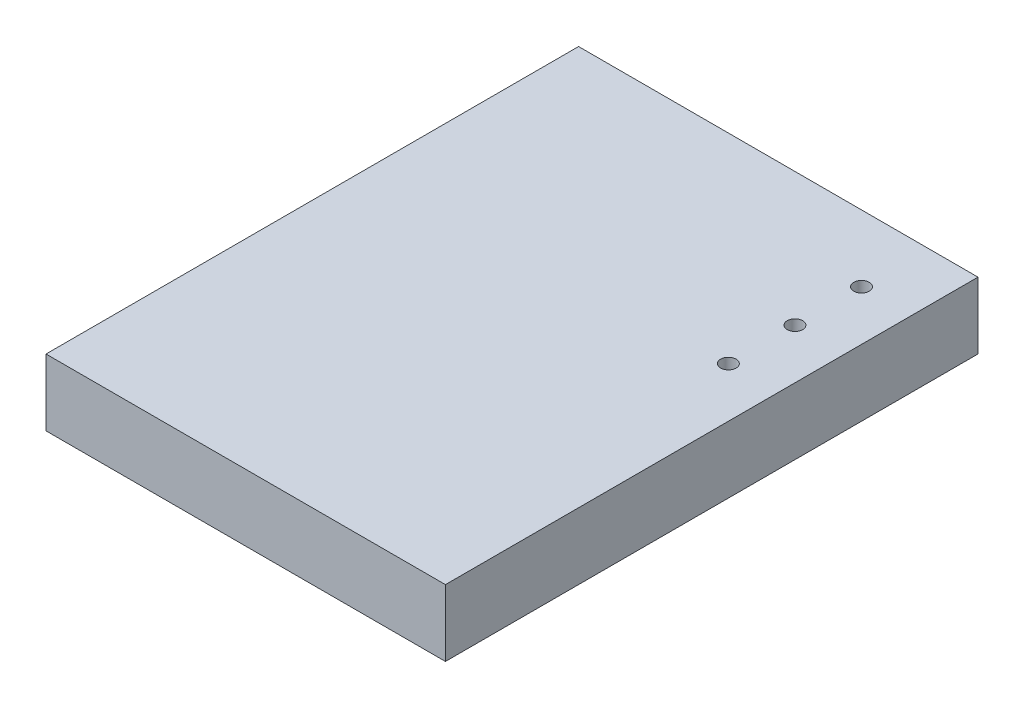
ISO-10303-21;
HEADER;
FILE_DESCRIPTION(('STEP AP214'),'2;1');
FILE_NAME('part.step','',(''),(''),'','','');
FILE_SCHEMA(('AUTOMOTIVE_DESIGN { 1 0 10303 214 1 1 1 1 }'));
ENDSEC;
DATA;
#1=APPLICATION_CONTEXT('core data for automotive mechanical design processes');
#2=APPLICATION_PROTOCOL_DEFINITION('international standard','automotive_design',2000,#1);
#3=PRODUCT_CONTEXT('',#1,'mechanical');
#4=PRODUCT('Part','Part','',(#3));
#5=PRODUCT_RELATED_PRODUCT_CATEGORY('part','',(#4));
#6=PRODUCT_DEFINITION_FORMATION('','',#4);
#7=PRODUCT_DEFINITION_CONTEXT('part definition',#1,'design');
#8=PRODUCT_DEFINITION('design','',#6,#7);
#9=PRODUCT_DEFINITION_SHAPE('','',#8);
#10=(LENGTH_UNIT() NAMED_UNIT(*) SI_UNIT(.MILLI.,.METRE.));
#11=(NAMED_UNIT(*) PLANE_ANGLE_UNIT() SI_UNIT($,.RADIAN.));
#12=(NAMED_UNIT(*) SI_UNIT($,.STERADIAN.) SOLID_ANGLE_UNIT());
#13=UNCERTAINTY_MEASURE_WITH_UNIT(LENGTH_MEASURE(1.E-05),#10,'distance_accuracy_value','');
#14=(GEOMETRIC_REPRESENTATION_CONTEXT(3) GLOBAL_UNCERTAINTY_ASSIGNED_CONTEXT((#13)) GLOBAL_UNIT_ASSIGNED_CONTEXT((#10,
#11,#12)) REPRESENTATION_CONTEXT('',''));
#15=CARTESIAN_POINT('',(0.,0.,0.));
#16=DIRECTION('',(0.,0.,1.));
#17=DIRECTION('',(1.,0.,0.));
#18=AXIS2_PLACEMENT_3D('',#15,#16,#17);
#19=CARTESIAN_POINT('',(0.,12.7,0.));
#20=DIRECTION('',(1.,0.,0.));
#21=DIRECTION('',(0.,0.,-1.));
#22=AXIS2_PLACEMENT_3D('',#19,#20,#21);
#23=PLANE('',#22);
#24=DIRECTION('',(0.,0.,1.));
#25=VECTOR('',#24,1.);
#26=CARTESIAN_POINT('',(0.,0.,0.));
#27=LINE('',#26,#25);
#28=CARTESIAN_POINT('',(0.,0.,0.));
#29=VERTEX_POINT('',#28);
#30=CARTESIAN_POINT('',(0.,0.,101.6));
#31=VERTEX_POINT('',#30);
#32=EDGE_CURVE('E102',#29,#31,#27,.T.);
#33=ORIENTED_EDGE('',*,*,#32,.T.);
#34=DIRECTION('',(0.,-1.,0.));
#35=VECTOR('',#34,1.);
#36=CARTESIAN_POINT('',(0.,12.7,101.6));
#37=LINE('',#36,#35);
#38=CARTESIAN_POINT('',(0.,12.7,101.6));
#39=VERTEX_POINT('',#38);
#40=EDGE_CURVE('E11',#39,#31,#37,.T.);
#41=ORIENTED_EDGE('',*,*,#40,.F.);
#42=DIRECTION('',(0.,0.,1.));
#43=VECTOR('',#42,1.);
#44=CARTESIAN_POINT('',(0.,12.7,0.));
#45=LINE('',#44,#43);
#46=CARTESIAN_POINT('',(0.,12.7,0.));
#47=VERTEX_POINT('',#46);
#48=EDGE_CURVE('E90',#47,#39,#45,.T.);
#49=ORIENTED_EDGE('',*,*,#48,.F.);
#50=DIRECTION('',(0.,-1.,0.));
#51=VECTOR('',#50,1.);
#52=CARTESIAN_POINT('',(0.,12.7,0.));
#53=LINE('',#52,#51);
#54=EDGE_CURVE('E98',#47,#29,#53,.T.);
#55=ORIENTED_EDGE('',*,*,#54,.T.);
#56=EDGE_LOOP('',(#33,#41,#49,#55));
#57=FACE_BOUND('',#56,.T.);
#58=ADVANCED_FACE('F39',(#57),#23,.F.);
#59=CARTESIAN_POINT('',(0.,12.7,101.6));
#60=DIRECTION('',(0.,0.,-1.));
#61=DIRECTION('',(-1.,0.,0.));
#62=AXIS2_PLACEMENT_3D('',#59,#60,#61);
#63=PLANE('',#62);
#64=DIRECTION('',(1.,0.,0.));
#65=VECTOR('',#64,1.);
#66=CARTESIAN_POINT('',(0.,0.,101.6));
#67=LINE('',#66,#65);
#68=CARTESIAN_POINT('',(76.2,0.,101.6));
#69=VERTEX_POINT('',#68);
#70=EDGE_CURVE('E94',#31,#69,#67,.T.);
#71=ORIENTED_EDGE('',*,*,#70,.T.);
#72=DIRECTION('',(0.,-1.,0.));
#73=VECTOR('',#72,1.);
#74=CARTESIAN_POINT('',(76.2,12.7,101.6));
#75=LINE('',#74,#73);
#76=CARTESIAN_POINT('',(76.2,12.7,101.6));
#77=VERTEX_POINT('',#76);
#78=EDGE_CURVE('E47',#77,#69,#75,.T.);
#79=ORIENTED_EDGE('',*,*,#78,.F.);
#80=DIRECTION('',(1.,0.,0.));
#81=VECTOR('',#80,1.);
#82=CARTESIAN_POINT('',(0.,12.7,101.6));
#83=LINE('',#82,#81);
#84=EDGE_CURVE('E85',#39,#77,#83,.T.);
#85=ORIENTED_EDGE('',*,*,#84,.F.);
#86=ORIENTED_EDGE('',*,*,#40,.T.);
#87=EDGE_LOOP('',(#71,#79,#85,#86));
#88=FACE_BOUND('',#87,.T.);
#89=ADVANCED_FACE('F93',(#88),#63,.F.);
#90=CARTESIAN_POINT('',(76.2,12.7,0.));
#91=DIRECTION('',(-1.,0.,0.));
#92=DIRECTION('',(0.,0.,1.));
#93=AXIS2_PLACEMENT_3D('',#90,#91,#92);
#94=PLANE('',#93);
#95=DIRECTION('',(0.,0.,-1.));
#96=VECTOR('',#95,1.);
#97=CARTESIAN_POINT('',(76.2,0.,0.));
#98=LINE('',#97,#96);
#99=CARTESIAN_POINT('',(76.2,0.,0.));
#100=VERTEX_POINT('',#99);
#101=EDGE_CURVE('E72',#69,#100,#98,.T.);
#102=ORIENTED_EDGE('',*,*,#101,.T.);
#103=DIRECTION('',(0.,-1.,0.));
#104=VECTOR('',#103,1.);
#105=CARTESIAN_POINT('',(76.2,12.7,0.));
#106=LINE('',#105,#104);
#107=CARTESIAN_POINT('',(76.2,12.7,0.));
#108=VERTEX_POINT('',#107);
#109=EDGE_CURVE('E95',#108,#100,#106,.T.);
#110=ORIENTED_EDGE('',*,*,#109,.F.);
#111=DIRECTION('',(0.,0.,-1.));
#112=VECTOR('',#111,1.);
#113=CARTESIAN_POINT('',(76.2,12.7,0.));
#114=LINE('',#113,#112);
#115=EDGE_CURVE('E88',#77,#108,#114,.T.);
#116=ORIENTED_EDGE('',*,*,#115,.F.);
#117=ORIENTED_EDGE('',*,*,#78,.T.);
#118=EDGE_LOOP('',(#102,#110,#116,#117));
#119=FACE_BOUND('',#118,.T.);
#120=ADVANCED_FACE('F96',(#119),#94,.F.);
#121=CARTESIAN_POINT('',(0.,12.7,0.));
#122=DIRECTION('',(0.,0.,1.));
#123=DIRECTION('',(1.,0.,0.));
#124=AXIS2_PLACEMENT_3D('',#121,#122,#123);
#125=PLANE('',#124);
#126=DIRECTION('',(-1.,0.,0.));
#127=VECTOR('',#126,1.);
#128=CARTESIAN_POINT('',(0.,0.,0.));
#129=LINE('',#128,#127);
#130=EDGE_CURVE('E78',#100,#29,#129,.T.);
#131=ORIENTED_EDGE('',*,*,#130,.T.);
#132=ORIENTED_EDGE('',*,*,#54,.F.);
#133=DIRECTION('',(-1.,0.,0.));
#134=VECTOR('',#133,1.);
#135=CARTESIAN_POINT('',(0.,12.7,0.));
#136=LINE('',#135,#134);
#137=EDGE_CURVE('E55',#108,#47,#136,.T.);
#138=ORIENTED_EDGE('',*,*,#137,.F.);
#139=ORIENTED_EDGE('',*,*,#109,.T.);
#140=EDGE_LOOP('',(#131,#132,#138,#139));
#141=FACE_BOUND('',#140,.T.);
#142=ADVANCED_FACE('F110',(#141),#125,.F.);
#143=CARTESIAN_POINT('',(0.,12.7,0.));
#144=DIRECTION('',(0.,1.,0.));
#145=DIRECTION('',(0.,0.,1.));
#146=AXIS2_PLACEMENT_3D('',#143,#144,#145);
#147=PLANE('',#146);
#148=CARTESIAN_POINT('',(66.675,12.7,12.7));
#149=DIRECTION('',(0.,1.,0.));
#150=DIRECTION('',(0.,0.,1.));
#151=AXIS2_PLACEMENT_3D('',#148,#149,#150);
#152=CIRCLE('',#151,1.47999999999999);
#153=CARTESIAN_POINT('',(66.675,12.7,14.18));
#154=VERTEX_POINT('',#153);
#155=EDGE_CURVE('E105',#154,#154,#152,.T.);
#156=ORIENTED_EDGE('',*,*,#155,.F.);
#157=EDGE_LOOP('',(#156));
#158=FACE_BOUND('',#157,.T.);
#159=CARTESIAN_POINT('',(66.675,12.7,25.4));
#160=DIRECTION('',(0.,1.,0.));
#161=DIRECTION('',(0.,0.,1.));
#162=AXIS2_PLACEMENT_3D('',#159,#160,#161);
#163=CIRCLE('',#162,1.47999999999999);
#164=CARTESIAN_POINT('',(66.675,12.7,26.88));
#165=VERTEX_POINT('',#164);
#166=EDGE_CURVE('E118',#165,#165,#163,.T.);
#167=ORIENTED_EDGE('',*,*,#166,.F.);
#168=EDGE_LOOP('',(#167));
#169=FACE_BOUND('',#168,.T.);
#170=CARTESIAN_POINT('',(66.675,12.7,38.1));
#171=DIRECTION('',(0.,1.,0.));
#172=DIRECTION('',(0.,0.,1.));
#173=AXIS2_PLACEMENT_3D('',#170,#171,#172);
#174=CIRCLE('',#173,1.47999999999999);
#175=CARTESIAN_POINT('',(66.675,12.7,39.58));
#176=VERTEX_POINT('',#175);
#177=EDGE_CURVE('E121',#176,#176,#174,.T.);
#178=ORIENTED_EDGE('',*,*,#177,.F.);
#179=EDGE_LOOP('',(#178));
#180=FACE_BOUND('',#179,.T.);
#181=ORIENTED_EDGE('',*,*,#48,.T.);
#182=ORIENTED_EDGE('',*,*,#84,.T.);
#183=ORIENTED_EDGE('',*,*,#115,.T.);
#184=ORIENTED_EDGE('',*,*,#137,.T.);
#185=EDGE_LOOP('',(#181,#182,#183,#184));
#186=FACE_BOUND('',#185,.T.);
#187=ADVANCED_FACE('F86',(#158,#169,#180,#186),#147,.T.);
#188=CARTESIAN_POINT('',(0.,0.,0.));
#189=DIRECTION('',(0.,1.,0.));
#190=DIRECTION('',(0.,0.,1.));
#191=AXIS2_PLACEMENT_3D('',#188,#189,#190);
#192=PLANE('',#191);
#193=CARTESIAN_POINT('',(66.675,0.,12.7));
#194=DIRECTION('',(0.,1.,0.));
#195=DIRECTION('',(0.,0.,1.));
#196=AXIS2_PLACEMENT_3D('',#193,#194,#195);
#197=CIRCLE('',#196,1.47999999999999);
#198=CARTESIAN_POINT('',(66.675,0.,14.18));
#199=VERTEX_POINT('',#198);
#200=EDGE_CURVE('E124',#199,#199,#197,.T.);
#201=ORIENTED_EDGE('',*,*,#200,.T.);
#202=EDGE_LOOP('',(#201));
#203=FACE_BOUND('',#202,.T.);
#204=CARTESIAN_POINT('',(66.675,0.,25.4));
#205=DIRECTION('',(0.,1.,0.));
#206=DIRECTION('',(0.,0.,1.));
#207=AXIS2_PLACEMENT_3D('',#204,#205,#206);
#208=CIRCLE('',#207,1.47999999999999);
#209=CARTESIAN_POINT('',(66.675,0.,26.88));
#210=VERTEX_POINT('',#209);
#211=EDGE_CURVE('E128',#210,#210,#208,.T.);
#212=ORIENTED_EDGE('',*,*,#211,.T.);
#213=EDGE_LOOP('',(#212));
#214=FACE_BOUND('',#213,.T.);
#215=CARTESIAN_POINT('',(66.675,0.,38.1));
#216=DIRECTION('',(0.,1.,0.));
#217=DIRECTION('',(0.,0.,1.));
#218=AXIS2_PLACEMENT_3D('',#215,#216,#217);
#219=CIRCLE('',#218,1.47999999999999);
#220=CARTESIAN_POINT('',(66.675,0.,39.58));
#221=VERTEX_POINT('',#220);
#222=EDGE_CURVE('E125',#221,#221,#219,.T.);
#223=ORIENTED_EDGE('',*,*,#222,.T.);
#224=EDGE_LOOP('',(#223));
#225=FACE_BOUND('',#224,.T.);
#226=ORIENTED_EDGE('',*,*,#32,.F.);
#227=ORIENTED_EDGE('',*,*,#130,.F.);
#228=ORIENTED_EDGE('',*,*,#101,.F.);
#229=ORIENTED_EDGE('',*,*,#70,.F.);
#230=EDGE_LOOP('',(#226,#227,#228,#229));
#231=FACE_BOUND('',#230,.T.);
#232=ADVANCED_FACE('F113',(#203,#214,#225,#231),#192,.F.);
#233=CARTESIAN_POINT('',(66.675,0.,38.1));
#234=DIRECTION('',(0.,1.,0.));
#235=DIRECTION('',(0.,0.,1.));
#236=AXIS2_PLACEMENT_3D('',#233,#234,#235);
#237=CYLINDRICAL_SURFACE('',#236,1.47999999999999);
#238=ORIENTED_EDGE('',*,*,#177,.T.);
#239=EDGE_LOOP('',(#238));
#240=FACE_BOUND('',#239,.T.);
#241=ORIENTED_EDGE('',*,*,#222,.F.);
#242=EDGE_LOOP('',(#241));
#243=FACE_BOUND('',#242,.T.);
#244=ADVANCED_FACE('F144',(#240,#243),#237,.F.);
#245=CARTESIAN_POINT('',(66.675,0.,25.4));
#246=DIRECTION('',(0.,1.,0.));
#247=DIRECTION('',(0.,0.,1.));
#248=AXIS2_PLACEMENT_3D('',#245,#246,#247);
#249=CYLINDRICAL_SURFACE('',#248,1.47999999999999);
#250=ORIENTED_EDGE('',*,*,#166,.T.);
#251=EDGE_LOOP('',(#250));
#252=FACE_BOUND('',#251,.T.);
#253=ORIENTED_EDGE('',*,*,#211,.F.);
#254=EDGE_LOOP('',(#253));
#255=FACE_BOUND('',#254,.T.);
#256=ADVANCED_FACE('F138',(#252,#255),#249,.F.);
#257=CARTESIAN_POINT('',(66.675,0.,12.7));
#258=DIRECTION('',(0.,1.,0.));
#259=DIRECTION('',(0.,0.,1.));
#260=AXIS2_PLACEMENT_3D('',#257,#258,#259);
#261=CYLINDRICAL_SURFACE('',#260,1.47999999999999);
#262=ORIENTED_EDGE('',*,*,#155,.T.);
#263=EDGE_LOOP('',(#262));
#264=FACE_BOUND('',#263,.T.);
#265=ORIENTED_EDGE('',*,*,#200,.F.);
#266=EDGE_LOOP('',(#265));
#267=FACE_BOUND('',#266,.T.);
#268=ADVANCED_FACE('F136',(#264,#267),#261,.F.);
#269=CLOSED_SHELL('',(#58,#89,#120,#142,#187,#232,#244,#256,#268));
#270=MANIFOLD_SOLID_BREP('B2',#269);
#271=ADVANCED_BREP_SHAPE_REPRESENTATION('',(#18,#270),#14);
#272=SHAPE_DEFINITION_REPRESENTATION(#9,#271);
ENDSEC;
END-ISO-10303-21;
